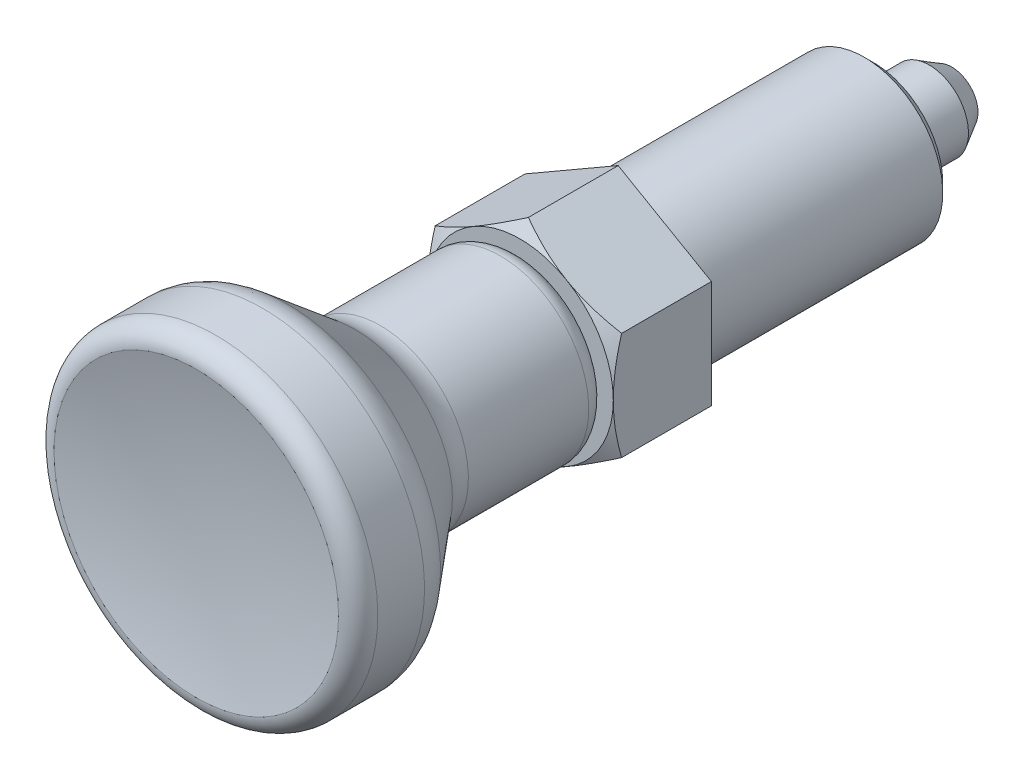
ISO-10303-21;
HEADER;
FILE_DESCRIPTION(('STEP AP214'),'2;1');
FILE_NAME('part.step','',(''),(''),'','','');
FILE_SCHEMA(('AUTOMOTIVE_DESIGN { 1 0 10303 214 1 1 1 1 }'));
ENDSEC;
DATA;
#1=APPLICATION_CONTEXT('core data for automotive mechanical design processes');
#2=APPLICATION_PROTOCOL_DEFINITION('international standard','automotive_design',2000,#1);
#3=PRODUCT_CONTEXT('',#1,'mechanical');
#4=PRODUCT('Part','Part','',(#3));
#5=PRODUCT_RELATED_PRODUCT_CATEGORY('part','',(#4));
#6=PRODUCT_DEFINITION_FORMATION('','',#4);
#7=PRODUCT_DEFINITION_CONTEXT('part definition',#1,'design');
#8=PRODUCT_DEFINITION('design','',#6,#7);
#9=PRODUCT_DEFINITION_SHAPE('','',#8);
#10=(LENGTH_UNIT() NAMED_UNIT(*) SI_UNIT(.MILLI.,.METRE.));
#11=(NAMED_UNIT(*) PLANE_ANGLE_UNIT() SI_UNIT($,.RADIAN.));
#12=(NAMED_UNIT(*) SI_UNIT($,.STERADIAN.) SOLID_ANGLE_UNIT());
#13=UNCERTAINTY_MEASURE_WITH_UNIT(LENGTH_MEASURE(1.E-05),#10,'distance_accuracy_value','');
#14=(GEOMETRIC_REPRESENTATION_CONTEXT(3) GLOBAL_UNCERTAINTY_ASSIGNED_CONTEXT((#13)) GLOBAL_UNIT_ASSIGNED_CONTEXT((#10,
#11,#12)) REPRESENTATION_CONTEXT('',''));
#15=CARTESIAN_POINT('',(0.,0.,0.));
#16=DIRECTION('',(0.,0.,1.));
#17=DIRECTION('',(1.,0.,0.));
#18=AXIS2_PLACEMENT_3D('',#15,#16,#17);
#19=CARTESIAN_POINT('',(0.,0.,7.11324865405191));
#20=DIRECTION('',(0.,0.,-1.));
#21=DIRECTION('',(0.,1.,0.));
#22=AXIS2_PLACEMENT_3D('',#19,#20,#21);
#23=CONICAL_SURFACE('',#22,14.5,1.0471975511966);
#24=CARTESIAN_POINT('',(-9.5,14.831186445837,5.31601754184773));
#25=CARTESIAN_POINT('',(-9.5,14.6233179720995,5.41707413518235));
#26=CARTESIAN_POINT('',(-9.5,14.4152082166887,5.51763419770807));
#27=CARTESIAN_POINT('',(-9.5,13.9984558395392,5.71764899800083));
#28=CARTESIAN_POINT('',(-9.5,13.7898132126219,5.81710372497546));
#29=CARTESIAN_POINT('',(-9.5,13.1629563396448,6.11366709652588));
#30=CARTESIAN_POINT('',(-9.5,12.7438730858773,6.30894569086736));
#31=CARTESIAN_POINT('',(-9.5,11.9007007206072,6.69449097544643));
#32=CARTESIAN_POINT('',(-9.5,11.4765968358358,6.88472543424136));
#33=CARTESIAN_POINT('',(-9.5,10.6250509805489,7.25754291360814));
#34=CARTESIAN_POINT('',(-9.5,10.1976091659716,7.44012628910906));
#35=CARTESIAN_POINT('',(-9.5,9.32451446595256,7.80149431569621));
#36=CARTESIAN_POINT('',(-9.5,8.87872644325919,7.97995423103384));
#37=CARTESIAN_POINT('',(-9.5,7.9819724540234,8.32360429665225));
#38=CARTESIAN_POINT('',(-9.5,7.53100591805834,8.48879297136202));
#39=CARTESIAN_POINT('',(-9.5,6.62398479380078,8.80163505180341));
#40=CARTESIAN_POINT('',(-9.5,6.16794229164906,8.94932312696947));
#41=CARTESIAN_POINT('',(-9.5,5.24933198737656,9.22249164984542));
#42=CARTESIAN_POINT('',(-9.5,4.78676625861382,9.34797898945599));
#43=CARTESIAN_POINT('',(-9.5,3.85736961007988,9.57010535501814));
#44=CARTESIAN_POINT('',(-9.5,3.39057816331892,9.66690512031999));
#45=CARTESIAN_POINT('',(-9.5,2.68606246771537,9.78645195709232));
#46=CARTESIAN_POINT('',(-9.5,2.45048585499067,9.82202702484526));
#47=CARTESIAN_POINT('',(-9.5,1.97812856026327,9.88393086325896));
#48=CARTESIAN_POINT('',(-9.5,1.7413479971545,9.91026052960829));
#49=CARTESIAN_POINT('',(-9.5,1.27003593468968,9.95281359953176));
#50=CARTESIAN_POINT('',(-9.5,1.0355161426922,9.96916614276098));
#51=CARTESIAN_POINT('',(-9.5,0.565994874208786,9.99193415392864));
#52=CARTESIAN_POINT('',(-9.5,0.330993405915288,9.99834978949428));
#53=CARTESIAN_POINT('',(-9.5,-0.139070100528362,10.0010905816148));
#54=CARTESIAN_POINT('',(-9.5,-0.374132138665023,9.9974157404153));
#55=CARTESIAN_POINT('',(-9.5,-0.843889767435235,9.98006674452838));
#56=CARTESIAN_POINT('',(-9.5,-1.07858533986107,9.96639210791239));
#57=CARTESIAN_POINT('',(-9.5,-1.63968713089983,9.92203744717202));
#58=CARTESIAN_POINT('',(-9.5,-1.96573914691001,9.88677643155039));
#59=CARTESIAN_POINT('',(-9.5,-2.61547197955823,9.79885612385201));
#60=CARTESIAN_POINT('',(-9.5,-2.93915247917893,9.74619454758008));
#61=CARTESIAN_POINT('',(-9.5,-3.9062404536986,9.56489716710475));
#62=CARTESIAN_POINT('',(-9.5,-4.54534395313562,9.41298013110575));
#63=CARTESIAN_POINT('',(-9.5,-5.5010788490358,9.14892008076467));
#64=CARTESIAN_POINT('',(-9.5,-5.82265147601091,9.05362699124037));
#65=CARTESIAN_POINT('',(-9.5,-6.46267510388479,8.8529854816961));
#66=CARTESIAN_POINT('',(-9.5,-6.78112608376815,8.74763699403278));
#67=CARTESIAN_POINT('',(-9.5,-7.41500318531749,8.52858799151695));
#68=CARTESIAN_POINT('',(-9.5,-7.730430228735,8.4148901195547));
#69=CARTESIAN_POINT('',(-9.5,-8.35866067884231,8.18049578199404));
#70=CARTESIAN_POINT('',(-9.5,-8.67146411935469,8.05979940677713));
#71=CARTESIAN_POINT('',(-9.5,-9.42126867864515,7.76237588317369));
#72=CARTESIAN_POINT('',(-9.5,-9.85713562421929,7.58279443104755));
#73=CARTESIAN_POINT('',(-9.5,-10.7250487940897,7.21459723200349));
#74=CARTESIAN_POINT('',(-9.5,-11.1570947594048,7.02598087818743));
#75=CARTESIAN_POINT('',(-9.5,-12.0180952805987,6.64156036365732));
#76=CARTESIAN_POINT('',(-9.5,-12.4470490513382,6.44575444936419));
#77=CARTESIAN_POINT('',(-9.5,-13.3022867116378,6.04843682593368));
#78=CARTESIAN_POINT('',(-9.5,-13.7285706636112,5.84692525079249));
#79=CARTESIAN_POINT('',(-9.5,-14.5794187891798,5.43904569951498));
#80=CARTESIAN_POINT('',(-9.5,-15.0039803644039,5.23267231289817));
#81=CARTESIAN_POINT('',(-9.5,-15.851242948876,4.81614147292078));
#82=CARTESIAN_POINT('',(-9.5,-16.2739439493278,4.60598400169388));
#83=CARTESIAN_POINT('',(-9.5,-17.1177171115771,4.18257534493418));
#84=CARTESIAN_POINT('',(-9.5,-17.5387894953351,3.96932460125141));
#85=CARTESIAN_POINT('',(-9.5,-18.3796041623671,3.5402154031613));
#86=CARTESIAN_POINT('',(-9.5,-18.7993464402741,3.32435693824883));
#87=CARTESIAN_POINT('',(-9.5,-19.9842654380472,2.71108738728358));
#88=CARTESIAN_POINT('',(-9.5,-20.7481213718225,2.31112448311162));
#89=CARTESIAN_POINT('',(-9.5,-22.2729985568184,1.50577288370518));
#90=CARTESIAN_POINT('',(-9.5,-23.0340196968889,1.10038397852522));
#91=CARTESIAN_POINT('',(-9.5,-24.5518349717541,0.286542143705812));
#92=CARTESIAN_POINT('',(-9.5,-25.3086349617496,-0.121899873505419));
#93=CARTESIAN_POINT('',(-9.5,-26.4425036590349,-0.736961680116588));
#94=CARTESIAN_POINT('',(-9.5,-26.8202271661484,-0.94237613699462));
#95=CARTESIAN_POINT('',(-9.5,-27.5752815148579,-1.35392414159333));
#96=CARTESIAN_POINT('',(-9.5,-27.9526123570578,-1.56005768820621));
#97=CARTESIAN_POINT('',(-9.5,-28.3297693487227,-1.76650892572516));
#98=B_SPLINE_CURVE_WITH_KNOTS('',3,(#24,#25,#26,#27,#28,#29,#30,#31,#32,#33,#34,#35,#36,#37,#38,
#39,#40,#41,#42,#43,#44,#45,#46,#47,#48,#49,#50,#51,#52,#53,#54,#55,#56,#57,#58,#59,#60,#61,#62,
#63,#64,#65,#66,#67,#68,#69,#70,#71,#72,#73,#74,#75,#76,#77,#78,#79,#80,#81,#82,#83,#84,#85,#86,
#87,#88,#89,#90,#91,#92,#93,#94,#95,#96,#97),.UNSPECIFIED.,.F.,.F.,(4,2,2,2,2,2,2,2,2,2,2,2,2,2,
2,2,2,2,2,2,2,2,2,2,2,2,2,2,2,2,2,2,2,2,2,2,4),(0.,0.693393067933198,1.38679290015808,
2.77379274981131,4.16817950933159,5.56250151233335,7.00288402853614,8.44342647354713,
9.88106566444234,11.3182577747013,12.7472379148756,13.4618279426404,14.176348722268,
14.881413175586,15.5864657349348,16.291518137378,16.9966045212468,17.9799102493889,
18.9633451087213,20.9312656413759,21.9373639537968,22.9434690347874,23.9492570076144,
24.9550319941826,26.3691296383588,27.7833224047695,29.1978624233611,30.6123692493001,
32.028532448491,33.4447023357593,34.860671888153,36.2766471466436,38.8633137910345,
41.4500808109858,44.0300197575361,45.3199150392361,46.6098083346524),.UNSPECIFIED.);
#99=CARTESIAN_POINT('',(-9.5,-5.4848275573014,9.15149422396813));
#100=VERTEX_POINT('',#99);
#101=CARTESIAN_POINT('',(-9.5,0.,10.));
#102=VERTEX_POINT('',#101);
#103=EDGE_CURVE('E9',#100,#102,#98,.F.);
#104=ORIENTED_EDGE('',*,*,#103,.F.);
#105=CARTESIAN_POINT('',(0.000200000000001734,-10.9697705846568,9.15142755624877));
#106=CARTESIAN_POINT('',(-0.208630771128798,-10.8492020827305,9.22102656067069));
#107=CARTESIAN_POINT('',(-0.418240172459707,-10.7281840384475,9.28746669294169));
#108=CARTESIAN_POINT('',(-0.839139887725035,-10.4851774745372,9.41315271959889));
#109=CARTESIAN_POINT('',(-1.05043073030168,-10.3631886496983,9.47239624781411));
#110=CARTESIAN_POINT('',(-1.68770779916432,-9.99525656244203,9.63818542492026));
#111=CARTESIAN_POINT('',(-2.11620976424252,-9.74786083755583,9.73248555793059));
#112=CARTESIAN_POINT('',(-2.75744333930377,-9.37764446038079,9.84306129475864));
#113=CARTESIAN_POINT('',(-2.96825921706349,-9.25592985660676,9.87456017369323));
#114=CARTESIAN_POINT('',(-3.39086703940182,-9.01193711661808,9.92738179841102));
#115=CARTESIAN_POINT('',(-3.60265900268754,-8.88965896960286,9.94870434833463));
#116=CARTESIAN_POINT('',(-4.02659621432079,-8.6448987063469,9.98062697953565));
#117=CARTESIAN_POINT('',(-4.23874074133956,-8.52241700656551,9.99123980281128));
#118=CARTESIAN_POINT('',(-4.66322575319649,-8.27734047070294,10.0015174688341));
#119=CARTESIAN_POINT('',(-4.87556623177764,-8.15474563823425,10.0011826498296));
#120=CARTESIAN_POINT('',(-5.27254199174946,-7.92555157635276,9.99032663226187));
#121=CARTESIAN_POINT('',(-5.45720529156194,-7.81893617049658,9.98112973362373));
#122=CARTESIAN_POINT('',(-5.82610000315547,-7.60595470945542,9.95463460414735));
#123=CARTESIAN_POINT('',(-6.01033138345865,-7.4995886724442,9.93733580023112));
#124=CARTESIAN_POINT('',(-6.56231167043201,-7.18090270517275,9.87369551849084));
#125=CARTESIAN_POINT('',(-6.92908353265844,-6.96914687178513,9.81561809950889));
#126=CARTESIAN_POINT('',(-7.66651782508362,-6.54338898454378,9.67042398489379));
#127=CARTESIAN_POINT('',(-8.03708614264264,-6.32944126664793,9.58269183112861));
#128=CARTESIAN_POINT('',(-8.77269671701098,-5.90473630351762,9.38357626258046));
#129=CARTESIAN_POINT('',(-9.137748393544,-5.69397361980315,9.27223961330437));
#130=CARTESIAN_POINT('',(-9.5002,-5.48471208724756,9.15142755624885));
#131=B_SPLINE_CURVE_WITH_KNOTS('',3,(#105,#106,#107,#108,#109,#110,#111,#112,#113,#114,#115,
#116,#117,#118,#119,#120,#121,#122,#123,#124,#125,#126,#127,#128,#129,#130),.UNSPECIFIED.,.F.,
.F.,(4,2,2,2,2,2,2,2,2,2,2,2,4),(0.,0.752880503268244,1.50600787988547,3.01546870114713,
3.75167336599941,4.4878921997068,5.22323407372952,5.95855322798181,6.59868084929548,
7.23885375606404,8.52010929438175,9.82978009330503,11.1368800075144),.UNSPECIFIED.);
#132=CARTESIAN_POINT('',(-4.75000000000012,-8.22724133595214,10.));
#133=VERTEX_POINT('',#132);
#134=EDGE_CURVE('E204',#133,#100,#131,.T.);
#135=ORIENTED_EDGE('',*,*,#134,.F.);
#136=CARTESIAN_POINT('',(0.,0.,10.));
#137=DIRECTION('',(0.,0.,1.));
#138=DIRECTION('',(0.,-1.,0.));
#139=AXIS2_PLACEMENT_3D('',#136,#137,#138);
#140=CIRCLE('',#139,9.5);
#141=EDGE_CURVE('E262',#102,#133,#140,.T.);
#142=ORIENTED_EDGE('',*,*,#141,.F.);
#143=EDGE_LOOP('',(#104,#135,#142));
#144=FACE_BOUND('',#143,.T.);
#145=ADVANCED_FACE('F14',(#144),#23,.T.);
#146=CARTESIAN_POINT('',(-9.5,5.4848275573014,9.15149422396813));
#147=VERTEX_POINT('',#146);
#148=EDGE_CURVE('E18',#102,#147,#98,.F.);
#149=ORIENTED_EDGE('',*,*,#148,.F.);
#150=CARTESIAN_POINT('',(-4.75000000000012,8.22724133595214,10.));
#151=VERTEX_POINT('',#150);
#152=EDGE_CURVE('E116',#151,#102,#140,.T.);
#153=ORIENTED_EDGE('',*,*,#152,.F.);
#154=CARTESIAN_POINT('',(-9.5002,5.48471208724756,9.15142755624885));
#155=CARTESIAN_POINT('',(-9.2913692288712,5.60528058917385,9.22102656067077));
#156=CARTESIAN_POINT('',(-9.0817598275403,5.72629863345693,9.28746669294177));
#157=CARTESIAN_POINT('',(-8.66086011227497,5.96930519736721,9.41315271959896));
#158=CARTESIAN_POINT('',(-8.44956926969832,6.09129402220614,9.47239624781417));
#159=CARTESIAN_POINT('',(-7.81229220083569,6.45922610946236,9.63818542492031));
#160=CARTESIAN_POINT('',(-7.38379023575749,6.70662183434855,9.73248555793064));
#161=CARTESIAN_POINT('',(-6.74255666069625,7.0768382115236,9.84306129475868));
#162=CARTESIAN_POINT('',(-6.53174078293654,7.19855281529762,9.87456017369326));
#163=CARTESIAN_POINT('',(-6.10913296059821,7.4425455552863,9.92738179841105));
#164=CARTESIAN_POINT('',(-5.89734099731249,7.56482370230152,9.94870434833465));
#165=CARTESIAN_POINT('',(-5.47340378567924,7.80958396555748,9.98062697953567));
#166=CARTESIAN_POINT('',(-5.26125925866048,7.93206566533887,9.99123980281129));
#167=CARTESIAN_POINT('',(-4.83677424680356,8.17714220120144,10.0015174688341));
#168=CARTESIAN_POINT('',(-4.6244337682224,8.29973703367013,10.0011826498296));
#169=CARTESIAN_POINT('',(-4.22745800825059,8.52893109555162,9.99032663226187));
#170=CARTESIAN_POINT('',(-4.0427947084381,8.6355465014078,9.98112973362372));
#171=CARTESIAN_POINT('',(-3.67389999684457,8.84852796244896,9.95463460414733));
#172=CARTESIAN_POINT('',(-3.48966861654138,8.95489399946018,9.9373358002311));
#173=CARTESIAN_POINT('',(-2.93768832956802,9.27357996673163,9.87369551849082));
#174=CARTESIAN_POINT('',(-2.57091646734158,9.48533580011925,9.81561809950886));
#175=CARTESIAN_POINT('',(-1.8334821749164,9.9110936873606,9.67042398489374));
#176=CARTESIAN_POINT('',(-1.46291385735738,10.1250414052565,9.58269183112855));
#177=CARTESIAN_POINT('',(-0.727303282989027,10.5497463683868,9.38357626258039));
#178=CARTESIAN_POINT('',(-0.362251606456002,10.7605090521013,9.2722396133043));
#179=CARTESIAN_POINT('',(0.000199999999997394,10.9697705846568,9.15142755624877));
#180=B_SPLINE_CURVE_WITH_KNOTS('',3,(#154,#155,#156,#157,#158,#159,#160,#161,#162,#163,#164,
#165,#166,#167,#168,#169,#170,#171,#172,#173,#174,#175,#176,#177,#178,#179),.UNSPECIFIED.,.F.,
.F.,(4,2,2,2,2,2,2,2,2,2,2,2,4),(0.,0.752880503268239,1.50600787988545,3.0154687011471,
3.75167336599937,4.48789219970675,5.22323407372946,5.95855322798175,6.59868084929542,
7.23885375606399,8.52010929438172,9.82978009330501,11.1368800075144),.UNSPECIFIED.);
#181=EDGE_CURVE('E265',#147,#151,#180,.T.);
#182=ORIENTED_EDGE('',*,*,#181,.F.);
#183=EDGE_LOOP('',(#149,#153,#182));
#184=FACE_BOUND('',#183,.T.);
#185=ADVANCED_FACE('F226',(#184),#23,.T.);
#186=CARTESIAN_POINT('',(0.,10.969655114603,9.15149422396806));
#187=VERTEX_POINT('',#186);
#188=EDGE_CURVE('E112',#151,#187,#180,.T.);
#189=ORIENTED_EDGE('',*,*,#188,.F.);
#190=CARTESIAN_POINT('',(4.75000000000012,8.22724133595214,10.));
#191=VERTEX_POINT('',#190);
#192=EDGE_CURVE('E110',#191,#151,#140,.T.);
#193=ORIENTED_EDGE('',*,*,#192,.F.);
#194=CARTESIAN_POINT('',(-0.000200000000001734,10.9697705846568,9.15142755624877));
#195=CARTESIAN_POINT('',(0.208630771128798,10.8492020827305,9.22102656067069));
#196=CARTESIAN_POINT('',(0.418240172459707,10.7281840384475,9.28746669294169));
#197=CARTESIAN_POINT('',(0.839139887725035,10.4851774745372,9.41315271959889));
#198=CARTESIAN_POINT('',(1.05043073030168,10.3631886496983,9.47239624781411));
#199=CARTESIAN_POINT('',(1.68770779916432,9.99525656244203,9.63818542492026));
#200=CARTESIAN_POINT('',(2.11620976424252,9.74786083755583,9.73248555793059));
#201=CARTESIAN_POINT('',(2.75744333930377,9.37764446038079,9.84306129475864));
#202=CARTESIAN_POINT('',(2.96825921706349,9.25592985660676,9.87456017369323));
#203=CARTESIAN_POINT('',(3.39086703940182,9.01193711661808,9.92738179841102));
#204=CARTESIAN_POINT('',(3.60265900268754,8.88965896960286,9.94870434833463));
#205=CARTESIAN_POINT('',(4.02659621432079,8.6448987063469,9.98062697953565));
#206=CARTESIAN_POINT('',(4.23874074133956,8.52241700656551,9.99123980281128));
#207=CARTESIAN_POINT('',(4.66322575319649,8.27734047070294,10.0015174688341));
#208=CARTESIAN_POINT('',(4.87556623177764,8.15474563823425,10.0011826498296));
#209=CARTESIAN_POINT('',(5.27254199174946,7.92555157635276,9.99032663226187));
#210=CARTESIAN_POINT('',(5.45720529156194,7.81893617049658,9.98112973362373));
#211=CARTESIAN_POINT('',(5.82610000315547,7.60595470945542,9.95463460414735));
#212=CARTESIAN_POINT('',(6.01033138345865,7.4995886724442,9.93733580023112));
#213=CARTESIAN_POINT('',(6.56231167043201,7.18090270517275,9.87369551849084));
#214=CARTESIAN_POINT('',(6.92908353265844,6.96914687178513,9.81561809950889));
#215=CARTESIAN_POINT('',(7.66651782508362,6.54338898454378,9.67042398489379));
#216=CARTESIAN_POINT('',(8.03708614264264,6.32944126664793,9.58269183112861));
#217=CARTESIAN_POINT('',(8.77269671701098,5.90473630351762,9.38357626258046));
#218=CARTESIAN_POINT('',(9.137748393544,5.69397361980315,9.27223961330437));
#219=CARTESIAN_POINT('',(9.5002,5.48471208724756,9.15142755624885));
#220=B_SPLINE_CURVE_WITH_KNOTS('',3,(#194,#195,#196,#197,#198,#199,#200,#201,#202,#203,#204,
#205,#206,#207,#208,#209,#210,#211,#212,#213,#214,#215,#216,#217,#218,#219),.UNSPECIFIED.,.F.,
.F.,(4,2,2,2,2,2,2,2,2,2,2,2,4),(0.,0.752880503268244,1.50600787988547,3.01546870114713,
3.75167336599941,4.4878921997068,5.22323407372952,5.95855322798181,6.59868084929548,
7.23885375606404,8.52010929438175,9.82978009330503,11.1368800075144),.UNSPECIFIED.);
#221=EDGE_CURVE('E90',#187,#191,#220,.T.);
#222=ORIENTED_EDGE('',*,*,#221,.F.);
#223=EDGE_LOOP('',(#189,#193,#222));
#224=FACE_BOUND('',#223,.T.);
#225=ADVANCED_FACE('F111',(#224),#23,.T.);
#226=CARTESIAN_POINT('',(0.,-10.969655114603,9.15149422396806));
#227=VERTEX_POINT('',#226);
#228=EDGE_CURVE('E199',#227,#133,#131,.T.);
#229=ORIENTED_EDGE('',*,*,#228,.F.);
#230=CARTESIAN_POINT('',(9.5002,-5.48471208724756,9.15142755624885));
#231=CARTESIAN_POINT('',(9.2913692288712,-5.60528058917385,9.22102656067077));
#232=CARTESIAN_POINT('',(9.0817598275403,-5.72629863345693,9.28746669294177));
#233=CARTESIAN_POINT('',(8.66086011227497,-5.96930519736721,9.41315271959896));
#234=CARTESIAN_POINT('',(8.44956926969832,-6.09129402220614,9.47239624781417));
#235=CARTESIAN_POINT('',(7.8122922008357,-6.45922610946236,9.63818542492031));
#236=CARTESIAN_POINT('',(7.38379023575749,-6.70662183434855,9.73248555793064));
#237=CARTESIAN_POINT('',(6.74255666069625,-7.0768382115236,9.84306129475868));
#238=CARTESIAN_POINT('',(6.53174078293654,-7.19855281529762,9.87456017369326));
#239=CARTESIAN_POINT('',(6.10913296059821,-7.4425455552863,9.92738179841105));
#240=CARTESIAN_POINT('',(5.89734099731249,-7.56482370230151,9.94870434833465));
#241=CARTESIAN_POINT('',(5.47340378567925,-7.80958396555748,9.98062697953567));
#242=CARTESIAN_POINT('',(5.26125925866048,-7.93206566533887,9.99123980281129));
#243=CARTESIAN_POINT('',(4.83677424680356,-8.17714220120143,10.0015174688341));
#244=CARTESIAN_POINT('',(4.6244337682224,-8.29973703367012,10.0011826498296));
#245=CARTESIAN_POINT('',(4.22745800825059,-8.52893109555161,9.99032663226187));
#246=CARTESIAN_POINT('',(4.0427947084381,-8.6355465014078,9.98112973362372));
#247=CARTESIAN_POINT('',(3.67389999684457,-8.84852796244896,9.95463460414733));
#248=CARTESIAN_POINT('',(3.48966861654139,-8.95489399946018,9.9373358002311));
#249=CARTESIAN_POINT('',(2.93768832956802,-9.27357996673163,9.87369551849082));
#250=CARTESIAN_POINT('',(2.57091646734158,-9.48533580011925,9.81561809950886));
#251=CARTESIAN_POINT('',(1.8334821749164,-9.9110936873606,9.67042398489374));
#252=CARTESIAN_POINT('',(1.46291385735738,-10.1250414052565,9.58269183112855));
#253=CARTESIAN_POINT('',(0.727303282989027,-10.5497463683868,9.38357626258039));
#254=CARTESIAN_POINT('',(0.362251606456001,-10.7605090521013,9.2722396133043));
#255=CARTESIAN_POINT('',(-0.000199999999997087,-10.9697705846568,9.15142755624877));
#256=B_SPLINE_CURVE_WITH_KNOTS('',3,(#230,#231,#232,#233,#234,#235,#236,#237,#238,#239,#240,
#241,#242,#243,#244,#245,#246,#247,#248,#249,#250,#251,#252,#253,#254,#255),.UNSPECIFIED.,.F.,
.F.,(4,2,2,2,2,2,2,2,2,2,2,2,4),(0.,0.752880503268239,1.50600787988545,3.01546870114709,
3.75167336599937,4.48789219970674,5.22323407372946,5.95855322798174,6.59868084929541,
7.23885375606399,8.52010929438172,9.82978009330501,11.1368800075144),.UNSPECIFIED.);
#257=CARTESIAN_POINT('',(4.75000000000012,-8.22724133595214,10.));
#258=VERTEX_POINT('',#257);
#259=EDGE_CURVE('E100',#258,#227,#256,.T.);
#260=ORIENTED_EDGE('',*,*,#259,.F.);
#261=EDGE_CURVE('E123',#133,#258,#140,.T.);
#262=ORIENTED_EDGE('',*,*,#261,.F.);
#263=EDGE_LOOP('',(#229,#260,#262));
#264=FACE_BOUND('',#263,.T.);
#265=ADVANCED_FACE('F244',(#264),#23,.T.);
#266=CARTESIAN_POINT('',(9.5,5.4848275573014,9.15149422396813));
#267=VERTEX_POINT('',#266);
#268=EDGE_CURVE('E94',#191,#267,#220,.T.);
#269=ORIENTED_EDGE('',*,*,#268,.F.);
#270=CARTESIAN_POINT('',(9.5,0.,10.));
#271=VERTEX_POINT('',#270);
#272=EDGE_CURVE('E106',#271,#191,#140,.T.);
#273=ORIENTED_EDGE('',*,*,#272,.F.);
#274=CARTESIAN_POINT('',(9.5,14.831186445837,5.31601754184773));
#275=CARTESIAN_POINT('',(9.5,14.6233179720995,5.41707413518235));
#276=CARTESIAN_POINT('',(9.5,14.4152082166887,5.51763419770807));
#277=CARTESIAN_POINT('',(9.5,13.9984558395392,5.71764899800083));
#278=CARTESIAN_POINT('',(9.5,13.7898132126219,5.81710372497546));
#279=CARTESIAN_POINT('',(9.5,13.1629563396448,6.11366709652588));
#280=CARTESIAN_POINT('',(9.5,12.7438730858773,6.30894569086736));
#281=CARTESIAN_POINT('',(9.5,11.9007007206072,6.69449097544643));
#282=CARTESIAN_POINT('',(9.5,11.4765968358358,6.88472543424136));
#283=CARTESIAN_POINT('',(9.5,10.6250509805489,7.25754291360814));
#284=CARTESIAN_POINT('',(9.5,10.1976091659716,7.44012628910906));
#285=CARTESIAN_POINT('',(9.5,9.32451446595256,7.80149431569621));
#286=CARTESIAN_POINT('',(9.5,8.87872644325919,7.97995423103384));
#287=CARTESIAN_POINT('',(9.5,7.9819724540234,8.32360429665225));
#288=CARTESIAN_POINT('',(9.5,7.53100591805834,8.48879297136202));
#289=CARTESIAN_POINT('',(9.5,6.62398479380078,8.80163505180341));
#290=CARTESIAN_POINT('',(9.5,6.16794229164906,8.94932312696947));
#291=CARTESIAN_POINT('',(9.5,5.24933198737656,9.22249164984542));
#292=CARTESIAN_POINT('',(9.5,4.78676625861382,9.34797898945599));
#293=CARTESIAN_POINT('',(9.5,3.85736961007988,9.57010535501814));
#294=CARTESIAN_POINT('',(9.5,3.39057816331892,9.66690512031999));
#295=CARTESIAN_POINT('',(9.5,2.68606246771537,9.78645195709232));
#296=CARTESIAN_POINT('',(9.5,2.45048585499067,9.82202702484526));
#297=CARTESIAN_POINT('',(9.5,1.97812856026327,9.88393086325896));
#298=CARTESIAN_POINT('',(9.5,1.7413479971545,9.91026052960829));
#299=CARTESIAN_POINT('',(9.5,1.27003593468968,9.95281359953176));
#300=CARTESIAN_POINT('',(9.5,1.0355161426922,9.96916614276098));
#301=CARTESIAN_POINT('',(9.5,0.565994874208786,9.99193415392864));
#302=CARTESIAN_POINT('',(9.5,0.330993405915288,9.99834978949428));
#303=CARTESIAN_POINT('',(9.5,-0.139070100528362,10.0010905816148));
#304=CARTESIAN_POINT('',(9.5,-0.374132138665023,9.9974157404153));
#305=CARTESIAN_POINT('',(9.5,-0.843889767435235,9.98006674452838));
#306=CARTESIAN_POINT('',(9.5,-1.07858533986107,9.96639210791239));
#307=CARTESIAN_POINT('',(9.5,-1.63968713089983,9.92203744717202));
#308=CARTESIAN_POINT('',(9.5,-1.96573914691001,9.88677643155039));
#309=CARTESIAN_POINT('',(9.5,-2.61547197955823,9.79885612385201));
#310=CARTESIAN_POINT('',(9.5,-2.93915247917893,9.74619454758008));
#311=CARTESIAN_POINT('',(9.5,-3.9062404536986,9.56489716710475));
#312=CARTESIAN_POINT('',(9.5,-4.54534395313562,9.41298013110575));
#313=CARTESIAN_POINT('',(9.5,-5.5010788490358,9.14892008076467));
#314=CARTESIAN_POINT('',(9.5,-5.82265147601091,9.05362699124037));
#315=CARTESIAN_POINT('',(9.5,-6.46267510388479,8.8529854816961));
#316=CARTESIAN_POINT('',(9.5,-6.78112608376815,8.74763699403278));
#317=CARTESIAN_POINT('',(9.5,-7.41500318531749,8.52858799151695));
#318=CARTESIAN_POINT('',(9.5,-7.730430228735,8.4148901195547));
#319=CARTESIAN_POINT('',(9.5,-8.35866067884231,8.18049578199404));
#320=CARTESIAN_POINT('',(9.5,-8.67146411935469,8.05979940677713));
#321=CARTESIAN_POINT('',(9.5,-9.42126867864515,7.76237588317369));
#322=CARTESIAN_POINT('',(9.5,-9.85713562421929,7.58279443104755));
#323=CARTESIAN_POINT('',(9.5,-10.7250487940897,7.21459723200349));
#324=CARTESIAN_POINT('',(9.5,-11.1570947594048,7.02598087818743));
#325=CARTESIAN_POINT('',(9.5,-12.0180952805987,6.64156036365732));
#326=CARTESIAN_POINT('',(9.5,-12.4470490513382,6.44575444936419));
#327=CARTESIAN_POINT('',(9.5,-13.3022867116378,6.04843682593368));
#328=CARTESIAN_POINT('',(9.5,-13.7285706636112,5.84692525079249));
#329=CARTESIAN_POINT('',(9.5,-14.5794187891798,5.43904569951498));
#330=CARTESIAN_POINT('',(9.5,-15.0039803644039,5.23267231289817));
#331=CARTESIAN_POINT('',(9.5,-15.851242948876,4.81614147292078));
#332=CARTESIAN_POINT('',(9.5,-16.2739439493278,4.60598400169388));
#333=CARTESIAN_POINT('',(9.5,-17.1177171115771,4.18257534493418));
#334=CARTESIAN_POINT('',(9.5,-17.5387894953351,3.96932460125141));
#335=CARTESIAN_POINT('',(9.5,-18.3796041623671,3.5402154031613));
#336=CARTESIAN_POINT('',(9.5,-18.7993464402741,3.32435693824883));
#337=CARTESIAN_POINT('',(9.5,-19.9842654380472,2.71108738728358));
#338=CARTESIAN_POINT('',(9.5,-20.7481213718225,2.31112448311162));
#339=CARTESIAN_POINT('',(9.5,-22.2729985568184,1.50577288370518));
#340=CARTESIAN_POINT('',(9.5,-23.0340196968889,1.10038397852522));
#341=CARTESIAN_POINT('',(9.5,-24.5518349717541,0.286542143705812));
#342=CARTESIAN_POINT('',(9.5,-25.3086349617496,-0.121899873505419));
#343=CARTESIAN_POINT('',(9.5,-26.4425036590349,-0.736961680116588));
#344=CARTESIAN_POINT('',(9.5,-26.8202271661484,-0.94237613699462));
#345=CARTESIAN_POINT('',(9.5,-27.5752815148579,-1.35392414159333));
#346=CARTESIAN_POINT('',(9.5,-27.9526123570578,-1.56005768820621));
#347=CARTESIAN_POINT('',(9.5,-28.3297693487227,-1.76650892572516));
#348=B_SPLINE_CURVE_WITH_KNOTS('',3,(#274,#275,#276,#277,#278,#279,#280,#281,#282,#283,#284,
#285,#286,#287,#288,#289,#290,#291,#292,#293,#294,#295,#296,#297,#298,#299,#300,#301,#302,#303,
#304,#305,#306,#307,#308,#309,#310,#311,#312,#313,#314,#315,#316,#317,#318,#319,#320,#321,#322,
#323,#324,#325,#326,#327,#328,#329,#330,#331,#332,#333,#334,#335,#336,#337,#338,#339,#340,#341,
#342,#343,#344,#345,#346,#347),.UNSPECIFIED.,.F.,.F.,(4,2,2,2,2,2,2,2,2,2,2,2,2,2,2,2,2,2,2,2,2,
2,2,2,2,2,2,2,2,2,2,2,2,2,2,2,4),(0.,0.693393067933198,1.38679290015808,2.77379274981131,
4.16817950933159,5.56250151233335,7.00288402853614,8.44342647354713,9.88106566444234,
11.3182577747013,12.7472379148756,13.4618279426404,14.176348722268,14.881413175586,
15.5864657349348,16.291518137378,16.9966045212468,17.9799102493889,18.9633451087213,
20.9312656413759,21.9373639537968,22.9434690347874,23.9492570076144,24.9550319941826,
26.3691296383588,27.7833224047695,29.1978624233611,30.6123692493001,32.028532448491,
33.4447023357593,34.860671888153,36.2766471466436,38.8633137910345,41.4500808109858,
44.0300197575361,45.3199150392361,46.6098083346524),.UNSPECIFIED.);
#349=EDGE_CURVE('E41',#267,#271,#348,.T.);
#350=ORIENTED_EDGE('',*,*,#349,.F.);
#351=EDGE_LOOP('',(#269,#273,#350));
#352=FACE_BOUND('',#351,.T.);
#353=ADVANCED_FACE('F104',(#352),#23,.T.);
#354=CARTESIAN_POINT('',(9.5,-5.4848275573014,9.15149422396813));
#355=VERTEX_POINT('',#354);
#356=EDGE_CURVE('E108',#355,#258,#256,.T.);
#357=ORIENTED_EDGE('',*,*,#356,.F.);
#358=EDGE_CURVE('E169',#271,#355,#348,.T.);
#359=ORIENTED_EDGE('',*,*,#358,.F.);
#360=EDGE_CURVE('E121',#258,#271,#140,.T.);
#361=ORIENTED_EDGE('',*,*,#360,.F.);
#362=EDGE_LOOP('',(#357,#359,#361));
#363=FACE_BOUND('',#362,.T.);
#364=ADVANCED_FACE('F228',(#363),#23,.T.);
#365=CARTESIAN_POINT('',(-1.11213122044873E-11,0.,107.387498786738));
#366=DIRECTION('',(0.,0.,1.));
#367=DIRECTION('',(1.,0.,0.));
#368=AXIS2_PLACEMENT_3D('',#365,#366,#367);
#369=SPHERICAL_SURFACE('',#368,66.0000000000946);
#370=CARTESIAN_POINT('',(0.,0.,43.));
#371=DIRECTION('',(0.,0.,1.));
#372=DIRECTION('',(0.,-1.,0.));
#373=AXIS2_PLACEMENT_3D('',#370,#371,#372);
#374=CIRCLE('',#373,14.500000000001);
#375=CARTESIAN_POINT('',(0.,-14.500000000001,43.));
#376=VERTEX_POINT('',#375);
#377=EDGE_CURVE('E166',#376,#376,#374,.T.);
#378=ORIENTED_EDGE('',*,*,#377,.T.);
#379=EDGE_LOOP('',(#378));
#380=FACE_BOUND('',#379,.T.);
#381=ADVANCED_FACE('F16',(#380),#369,.F.);
#382=CARTESIAN_POINT('',(0.,0.,41.));
#383=DIRECTION('',(0.,0.,1.));
#384=DIRECTION('',(0.,-1.,0.));
#385=AXIS2_PLACEMENT_3D('',#382,#383,#384);
#386=TOROIDAL_SURFACE('',#385,14.4999999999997,2.00000000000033);
#387=CARTESIAN_POINT('',(0.,0.,41.));
#388=DIRECTION('',(0.,0.,1.));
#389=DIRECTION('',(0.,-1.,0.));
#390=AXIS2_PLACEMENT_3D('',#387,#388,#389);
#391=CIRCLE('',#390,16.5);
#392=CARTESIAN_POINT('',(0.,-16.5,41.));
#393=VERTEX_POINT('',#392);
#394=EDGE_CURVE('E163',#393,#393,#391,.T.);
#395=ORIENTED_EDGE('',*,*,#394,.T.);
#396=EDGE_LOOP('',(#395));
#397=FACE_BOUND('',#396,.T.);
#398=ORIENTED_EDGE('',*,*,#377,.F.);
#399=EDGE_LOOP('',(#398));
#400=FACE_BOUND('',#399,.T.);
#401=ADVANCED_FACE('F242',(#397,#400),#386,.T.);
#402=CARTESIAN_POINT('',(0.,0.,-34.));
#403=DIRECTION('',(0.,0.,1.));
#404=DIRECTION('',(0.,-1.,0.));
#405=AXIS2_PLACEMENT_3D('',#402,#403,#404);
#406=CYLINDRICAL_SURFACE('',#405,16.5);
#407=CARTESIAN_POINT('',(0.,0.,36.235930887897));
#408=DIRECTION('',(0.,0.,1.));
#409=DIRECTION('',(0.,-1.,0.));
#410=AXIS2_PLACEMENT_3D('',#407,#408,#409);
#411=CIRCLE('',#410,16.5);
#412=CARTESIAN_POINT('',(0.,-16.5,36.235930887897));
#413=VERTEX_POINT('',#412);
#414=EDGE_CURVE('E160',#413,#413,#411,.T.);
#415=ORIENTED_EDGE('',*,*,#414,.T.);
#416=EDGE_LOOP('',(#415));
#417=FACE_BOUND('',#416,.T.);
#418=ORIENTED_EDGE('',*,*,#394,.F.);
#419=EDGE_LOOP('',(#418));
#420=FACE_BOUND('',#419,.T.);
#421=ADVANCED_FACE('F342',(#417,#420),#406,.T.);
#422=CARTESIAN_POINT('',(0.,0.,36.2359308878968));
#423=DIRECTION('',(0.,0.,1.));
#424=DIRECTION('',(0.,-1.,0.));
#425=AXIS2_PLACEMENT_3D('',#422,#423,#424);
#426=TOROIDAL_SURFACE('',#425,12.499999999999,4.00000000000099);
#427=CARTESIAN_POINT('',(0.,0.,33.691913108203));
#428=DIRECTION('',(0.,0.,1.));
#429=DIRECTION('',(0.,-1.,0.));
#430=AXIS2_PLACEMENT_3D('',#427,#428,#429);
#431=CIRCLE('',#430,15.586741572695);
#432=CARTESIAN_POINT('',(0.,-15.586741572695,33.691913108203));
#433=VERTEX_POINT('',#432);
#434=EDGE_CURVE('E157',#433,#433,#431,.T.);
#435=ORIENTED_EDGE('',*,*,#434,.T.);
#436=EDGE_LOOP('',(#435));
#437=FACE_BOUND('',#436,.T.);
#438=ORIENTED_EDGE('',*,*,#414,.F.);
#439=EDGE_LOOP('',(#438));
#440=FACE_BOUND('',#439,.T.);
#441=ADVANCED_FACE('F338',(#437,#440),#426,.T.);
#442=CARTESIAN_POINT('',(0.,0.,33.691913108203));
#443=DIRECTION('',(0.,0.,1.));
#444=DIRECTION('',(0.,-1.,0.));
#445=AXIS2_PLACEMENT_3D('',#442,#443,#444);
#446=CONICAL_SURFACE('',#445,15.586741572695,0.689309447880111);
#447=CARTESIAN_POINT('',(0.,0.,26.808086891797));
#448=DIRECTION('',(0.,0.,1.));
#449=DIRECTION('',(0.,-1.,0.));
#450=AXIS2_PLACEMENT_3D('',#447,#448,#449);
#451=CIRCLE('',#450,9.9132584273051);
#452=CARTESIAN_POINT('',(0.,-9.9132584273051,26.808086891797));
#453=VERTEX_POINT('',#452);
#454=EDGE_CURVE('E154',#453,#453,#451,.T.);
#455=ORIENTED_EDGE('',*,*,#454,.T.);
#456=EDGE_LOOP('',(#455));
#457=FACE_BOUND('',#456,.T.);
#458=ORIENTED_EDGE('',*,*,#434,.F.);
#459=EDGE_LOOP('',(#458));
#460=FACE_BOUND('',#459,.T.);
#461=ADVANCED_FACE('F334',(#457,#460),#446,.T.);
#462=CARTESIAN_POINT('',(0.,0.,24.2640691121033));
#463=DIRECTION('',(0.,0.,1.));
#464=DIRECTION('',(0.,-1.,0.));
#465=AXIS2_PLACEMENT_3D('',#462,#463,#464);
#466=TOROIDAL_SURFACE('',#465,13.0000000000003,4.00000000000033);
#467=CARTESIAN_POINT('',(0.,0.,24.264069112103));
#468=DIRECTION('',(0.,0.,1.));
#469=DIRECTION('',(0.,-1.,0.));
#470=AXIS2_PLACEMENT_3D('',#467,#468,#469);
#471=CIRCLE('',#470,9.);
#472=CARTESIAN_POINT('',(0.,-9.,24.264069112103));
#473=VERTEX_POINT('',#472);
#474=EDGE_CURVE('E151',#473,#473,#471,.T.);
#475=ORIENTED_EDGE('',*,*,#474,.T.);
#476=EDGE_LOOP('',(#475));
#477=FACE_BOUND('',#476,.T.);
#478=ORIENTED_EDGE('',*,*,#454,.F.);
#479=EDGE_LOOP('',(#478));
#480=FACE_BOUND('',#479,.T.);
#481=ADVANCED_FACE('F330',(#477,#480),#466,.F.);
#482=CARTESIAN_POINT('',(0.,0.,-34.));
#483=DIRECTION('',(0.,0.,1.));
#484=DIRECTION('',(0.,-1.,0.));
#485=AXIS2_PLACEMENT_3D('',#482,#483,#484);
#486=CYLINDRICAL_SURFACE('',#485,9.);
#487=CARTESIAN_POINT('',(0.,0.,12.));
#488=DIRECTION('',(0.,0.,1.));
#489=DIRECTION('',(0.,-1.,0.));
#490=AXIS2_PLACEMENT_3D('',#487,#488,#489);
#491=CIRCLE('',#490,9.);
#492=CARTESIAN_POINT('',(0.,-9.,12.));
#493=VERTEX_POINT('',#492);
#494=EDGE_CURVE('E148',#493,#493,#491,.T.);
#495=ORIENTED_EDGE('',*,*,#494,.T.);
#496=EDGE_LOOP('',(#495));
#497=FACE_BOUND('',#496,.T.);
#498=ORIENTED_EDGE('',*,*,#474,.F.);
#499=EDGE_LOOP('',(#498));
#500=FACE_BOUND('',#499,.T.);
#501=ADVANCED_FACE('F326',(#497,#500),#486,.T.);
#502=CARTESIAN_POINT('',(0.,0.,12.));
#503=DIRECTION('',(0.,0.,1.));
#504=DIRECTION('',(0.,-1.,0.));
#505=AXIS2_PLACEMENT_3D('',#502,#503,#504);
#506=TOROIDAL_SURFACE('',#505,7.,2.);
#507=CARTESIAN_POINT('',(0.,0.,10.));
#508=DIRECTION('',(0.,0.,1.));
#509=DIRECTION('',(0.,-1.,0.));
#510=AXIS2_PLACEMENT_3D('',#507,#508,#509);
#511=CIRCLE('',#510,7.);
#512=CARTESIAN_POINT('',(0.,-7.,10.));
#513=VERTEX_POINT('',#512);
#514=EDGE_CURVE('E145',#513,#513,#511,.T.);
#515=ORIENTED_EDGE('',*,*,#514,.T.);
#516=EDGE_LOOP('',(#515));
#517=FACE_BOUND('',#516,.T.);
#518=ORIENTED_EDGE('',*,*,#494,.F.);
#519=EDGE_LOOP('',(#518));
#520=FACE_BOUND('',#519,.T.);
#521=ADVANCED_FACE('F315',(#517,#520),#506,.T.);
#522=CARTESIAN_POINT('',(9.5,0.,10.));
#523=DIRECTION('',(0.,0.,-1.));
#524=DIRECTION('',(0.,1.,0.));
#525=AXIS2_PLACEMENT_3D('',#522,#523,#524);
#526=PLANE('',#525);
#527=ORIENTED_EDGE('',*,*,#514,.F.);
#528=EDGE_LOOP('',(#527));
#529=FACE_BOUND('',#528,.T.);
#530=ORIENTED_EDGE('',*,*,#360,.T.);
#531=ORIENTED_EDGE('',*,*,#272,.T.);
#532=ORIENTED_EDGE('',*,*,#192,.T.);
#533=ORIENTED_EDGE('',*,*,#152,.T.);
#534=ORIENTED_EDGE('',*,*,#141,.T.);
#535=ORIENTED_EDGE('',*,*,#261,.T.);
#536=EDGE_LOOP('',(#530,#531,#532,#533,#534,#535));
#537=FACE_BOUND('',#536,.T.);
#538=ADVANCED_FACE('F118',(#529,#537),#526,.F.);
#539=CARTESIAN_POINT('',(9.5,5.4848275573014,-2.));
#540=DIRECTION('',(0.500000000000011,0.866025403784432,0.));
#541=DIRECTION('',(-0.866025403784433,0.500000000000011,0.));
#542=AXIS2_PLACEMENT_3D('',#539,#540,#541);
#543=PLANE('',#542);
#544=DIRECTION('',(-0.866025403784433,0.500000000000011,0.));
#545=VECTOR('',#544,1.);
#546=CARTESIAN_POINT('',(10.75,4.76313972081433,0.));
#547=LINE('',#546,#545);
#548=CARTESIAN_POINT('',(9.5,5.4848275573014,0.));
#549=VERTEX_POINT('',#548);
#550=CARTESIAN_POINT('',(0.,10.969655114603,0.));
#551=VERTEX_POINT('',#550);
#552=EDGE_CURVE('E126',#549,#551,#547,.T.);
#553=ORIENTED_EDGE('',*,*,#552,.T.);
#554=DIRECTION('',(0.,0.,1.));
#555=VECTOR('',#554,1.);
#556=CARTESIAN_POINT('',(0.,10.969655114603,-2.));
#557=LINE('',#556,#555);
#558=EDGE_CURVE('E96',#551,#187,#557,.T.);
#559=ORIENTED_EDGE('',*,*,#558,.T.);
#560=ORIENTED_EDGE('',*,*,#221,.T.);
#561=ORIENTED_EDGE('',*,*,#268,.T.);
#562=DIRECTION('',(0.,0.,1.));
#563=VECTOR('',#562,1.);
#564=CARTESIAN_POINT('',(9.5,5.4848275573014,-2.));
#565=LINE('',#564,#563);
#566=EDGE_CURVE('E285',#549,#267,#565,.T.);
#567=ORIENTED_EDGE('',*,*,#566,.F.);
#568=EDGE_LOOP('',(#553,#559,#560,#561,#567));
#569=FACE_BOUND('',#568,.T.);
#570=ADVANCED_FACE('F92',(#569),#543,.T.);
#571=CARTESIAN_POINT('',(0.,10.969655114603,-2.));
#572=DIRECTION('',(-0.500000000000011,0.866025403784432,0.));
#573=DIRECTION('',(-0.866025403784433,-0.500000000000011,0.));
#574=AXIS2_PLACEMENT_3D('',#571,#572,#573);
#575=PLANE('',#574);
#576=DIRECTION('',(-0.866025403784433,-0.500000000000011,0.));
#577=VECTOR('',#576,1.);
#578=CARTESIAN_POINT('',(1.2499999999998,11.6913429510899,0.));
#579=LINE('',#578,#577);
#580=CARTESIAN_POINT('',(-9.5,5.4848275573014,0.));
#581=VERTEX_POINT('',#580);
#582=EDGE_CURVE('E269',#551,#581,#579,.T.);
#583=ORIENTED_EDGE('',*,*,#582,.T.);
#584=DIRECTION('',(0.,0.,1.));
#585=VECTOR('',#584,1.);
#586=CARTESIAN_POINT('',(-9.5,5.4848275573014,-2.));
#587=LINE('',#586,#585);
#588=EDGE_CURVE('E272',#581,#147,#587,.T.);
#589=ORIENTED_EDGE('',*,*,#588,.T.);
#590=ORIENTED_EDGE('',*,*,#181,.T.);
#591=ORIENTED_EDGE('',*,*,#188,.T.);
#592=ORIENTED_EDGE('',*,*,#558,.F.);
#593=EDGE_LOOP('',(#583,#589,#590,#591,#592));
#594=FACE_BOUND('',#593,.T.);
#595=ADVANCED_FACE('F193',(#594),#575,.T.);
#596=CARTESIAN_POINT('',(-9.5,5.4848275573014,-2.));
#597=DIRECTION('',(-1.,0.,0.));
#598=DIRECTION('',(0.,-1.,0.));
#599=AXIS2_PLACEMENT_3D('',#596,#597,#598);
#600=PLANE('',#599);
#601=DIRECTION('',(0.,-1.,0.));
#602=VECTOR('',#601,1.);
#603=CARTESIAN_POINT('',(-9.5,0.,0.));
#604=LINE('',#603,#602);
#605=CARTESIAN_POINT('',(-9.5,-5.4848275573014,0.));
#606=VERTEX_POINT('',#605);
#607=EDGE_CURVE('E278',#581,#606,#604,.T.);
#608=ORIENTED_EDGE('',*,*,#607,.T.);
#609=DIRECTION('',(0.,0.,1.));
#610=VECTOR('',#609,1.);
#611=CARTESIAN_POINT('',(-9.5,-5.4848275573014,-2.));
#612=LINE('',#611,#610);
#613=EDGE_CURVE('E259',#606,#100,#612,.T.);
#614=ORIENTED_EDGE('',*,*,#613,.T.);
#615=ORIENTED_EDGE('',*,*,#103,.T.);
#616=ORIENTED_EDGE('',*,*,#148,.T.);
#617=ORIENTED_EDGE('',*,*,#588,.F.);
#618=EDGE_LOOP('',(#608,#614,#615,#616,#617));
#619=FACE_BOUND('',#618,.T.);
#620=ADVANCED_FACE('F213',(#619),#600,.T.);
#621=CARTESIAN_POINT('',(-9.5,-5.4848275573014,-2.));
#622=DIRECTION('',(-0.500000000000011,-0.866025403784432,0.));
#623=DIRECTION('',(0.866025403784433,-0.500000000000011,0.));
#624=AXIS2_PLACEMENT_3D('',#621,#622,#623);
#625=PLANE('',#624);
#626=DIRECTION('',(0.866025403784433,-0.500000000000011,0.));
#627=VECTOR('',#626,1.);
#628=CARTESIAN_POINT('',(1.2499999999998,-11.6913429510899,0.));
#629=LINE('',#628,#627);
#630=CARTESIAN_POINT('',(0.,-10.969655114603,0.));
#631=VERTEX_POINT('',#630);
#632=EDGE_CURVE('E258',#606,#631,#629,.T.);
#633=ORIENTED_EDGE('',*,*,#632,.T.);
#634=DIRECTION('',(0.,0.,1.));
#635=VECTOR('',#634,1.);
#636=CARTESIAN_POINT('',(0.,-10.969655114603,-2.));
#637=LINE('',#636,#635);
#638=EDGE_CURVE('E250',#631,#227,#637,.T.);
#639=ORIENTED_EDGE('',*,*,#638,.T.);
#640=ORIENTED_EDGE('',*,*,#228,.T.);
#641=ORIENTED_EDGE('',*,*,#134,.T.);
#642=ORIENTED_EDGE('',*,*,#613,.F.);
#643=EDGE_LOOP('',(#633,#639,#640,#641,#642));
#644=FACE_BOUND('',#643,.T.);
#645=ADVANCED_FACE('F210',(#644),#625,.T.);
#646=CARTESIAN_POINT('',(0.,-10.969655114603,-2.));
#647=DIRECTION('',(0.500000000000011,-0.866025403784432,0.));
#648=DIRECTION('',(0.866025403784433,0.500000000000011,0.));
#649=AXIS2_PLACEMENT_3D('',#646,#647,#648);
#650=PLANE('',#649);
#651=DIRECTION('',(0.866025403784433,0.500000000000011,0.));
#652=VECTOR('',#651,1.);
#653=CARTESIAN_POINT('',(10.75,-4.76313972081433,0.));
#654=LINE('',#653,#652);
#655=CARTESIAN_POINT('',(9.5,-5.4848275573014,0.));
#656=VERTEX_POINT('',#655);
#657=EDGE_CURVE('E282',#631,#656,#654,.T.);
#658=ORIENTED_EDGE('',*,*,#657,.T.);
#659=DIRECTION('',(0.,0.,1.));
#660=VECTOR('',#659,1.);
#661=CARTESIAN_POINT('',(9.5,-5.4848275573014,-2.));
#662=LINE('',#661,#660);
#663=EDGE_CURVE('E35',#656,#355,#662,.T.);
#664=ORIENTED_EDGE('',*,*,#663,.T.);
#665=ORIENTED_EDGE('',*,*,#356,.T.);
#666=ORIENTED_EDGE('',*,*,#259,.T.);
#667=ORIENTED_EDGE('',*,*,#638,.F.);
#668=EDGE_LOOP('',(#658,#664,#665,#666,#667));
#669=FACE_BOUND('',#668,.T.);
#670=ADVANCED_FACE('F188',(#669),#650,.T.);
#671=CARTESIAN_POINT('',(9.5,-5.4848275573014,-2.));
#672=DIRECTION('',(1.,0.,0.));
#673=DIRECTION('',(0.,1.,0.));
#674=AXIS2_PLACEMENT_3D('',#671,#672,#673);
#675=PLANE('',#674);
#676=DIRECTION('',(0.,1.,0.));
#677=VECTOR('',#676,1.);
#678=CARTESIAN_POINT('',(9.5,0.,0.));
#679=LINE('',#678,#677);
#680=EDGE_CURVE('E271',#656,#549,#679,.T.);
#681=ORIENTED_EDGE('',*,*,#680,.T.);
#682=ORIENTED_EDGE('',*,*,#566,.T.);
#683=ORIENTED_EDGE('',*,*,#349,.T.);
#684=ORIENTED_EDGE('',*,*,#358,.T.);
#685=ORIENTED_EDGE('',*,*,#663,.F.);
#686=EDGE_LOOP('',(#681,#682,#683,#684,#685));
#687=FACE_BOUND('',#686,.T.);
#688=ADVANCED_FACE('F184',(#687),#675,.T.);
#689=CARTESIAN_POINT('',(8.,0.,0.));
#690=DIRECTION('',(0.,0.,1.));
#691=DIRECTION('',(0.,-1.,0.));
#692=AXIS2_PLACEMENT_3D('',#689,#690,#691);
#693=PLANE('',#692);
#694=CARTESIAN_POINT('',(0.,0.,0.));
#695=DIRECTION('',(0.,0.,1.));
#696=DIRECTION('',(0.,-1.,0.));
#697=AXIS2_PLACEMENT_3D('',#694,#695,#696);
#698=CIRCLE('',#697,8.);
#699=CARTESIAN_POINT('',(0.,-8.,0.));
#700=VERTEX_POINT('',#699);
#701=EDGE_CURVE('E122',#700,#700,#698,.T.);
#702=ORIENTED_EDGE('',*,*,#701,.T.);
#703=EDGE_LOOP('',(#702));
#704=FACE_BOUND('',#703,.T.);
#705=ORIENTED_EDGE('',*,*,#552,.F.);
#706=ORIENTED_EDGE('',*,*,#680,.F.);
#707=ORIENTED_EDGE('',*,*,#657,.F.);
#708=ORIENTED_EDGE('',*,*,#632,.F.);
#709=ORIENTED_EDGE('',*,*,#607,.F.);
#710=ORIENTED_EDGE('',*,*,#582,.F.);
#711=EDGE_LOOP('',(#705,#706,#707,#708,#709,#710));
#712=FACE_BOUND('',#711,.T.);
#713=ADVANCED_FACE('F187',(#704,#712),#693,.F.);
#714=CARTESIAN_POINT('',(2.6720943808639,0.,-34.));
#715=DIRECTION('',(0.,0.,-1.));
#716=DIRECTION('',(0.,1.,0.));
#717=AXIS2_PLACEMENT_3D('',#714,#715,#716);
#718=PLANE('',#717);
#719=CARTESIAN_POINT('',(0.,0.,-34.));
#720=DIRECTION('',(0.,0.,1.));
#721=DIRECTION('',(0.,-1.,0.));
#722=AXIS2_PLACEMENT_3D('',#719,#720,#721);
#723=CIRCLE('',#722,2.6720943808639);
#724=CARTESIAN_POINT('',(0.,-2.6720943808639,-34.));
#725=VERTEX_POINT('',#724);
#726=EDGE_CURVE('E139',#725,#725,#723,.T.);
#727=ORIENTED_EDGE('',*,*,#726,.F.);
#728=EDGE_LOOP('',(#727));
#729=FACE_BOUND('',#728,.T.);
#730=ADVANCED_FACE('F291',(#729),#718,.T.);
#731=CARTESIAN_POINT('',(0.,0.,-31.7));
#732=DIRECTION('',(0.,0.,1.));
#733=DIRECTION('',(0.,-1.,0.));
#734=AXIS2_PLACEMENT_3D('',#731,#732,#733);
#735=CONICAL_SURFACE('',#734,4.,0.523598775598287);
#736=ORIENTED_EDGE('',*,*,#726,.T.);
#737=EDGE_LOOP('',(#736));
#738=FACE_BOUND('',#737,.T.);
#739=CARTESIAN_POINT('',(0.,0.,-31.7));
#740=DIRECTION('',(0.,0.,1.));
#741=DIRECTION('',(0.,-1.,0.));
#742=AXIS2_PLACEMENT_3D('',#739,#740,#741);
#743=CIRCLE('',#742,4.);
#744=CARTESIAN_POINT('',(0.,-4.,-31.7));
#745=VERTEX_POINT('',#744);
#746=EDGE_CURVE('E142',#745,#745,#743,.T.);
#747=ORIENTED_EDGE('',*,*,#746,.F.);
#748=EDGE_LOOP('',(#747));
#749=FACE_BOUND('',#748,.T.);
#750=ADVANCED_FACE('F297',(#738,#749),#735,.T.);
#751=CARTESIAN_POINT('',(0.,0.,-34.));
#752=DIRECTION('',(0.,0.,1.));
#753=DIRECTION('',(0.,-1.,0.));
#754=AXIS2_PLACEMENT_3D('',#751,#752,#753);
#755=CYLINDRICAL_SURFACE('',#754,4.);
#756=ORIENTED_EDGE('',*,*,#746,.T.);
#757=EDGE_LOOP('',(#756));
#758=FACE_BOUND('',#757,.T.);
#759=CARTESIAN_POINT('',(0.,0.,-26.));
#760=DIRECTION('',(0.,0.,1.));
#761=DIRECTION('',(0.,-1.,0.));
#762=AXIS2_PLACEMENT_3D('',#759,#760,#761);
#763=CIRCLE('',#762,4.);
#764=CARTESIAN_POINT('',(0.,-4.,-26.));
#765=VERTEX_POINT('',#764);
#766=EDGE_CURVE('E136',#765,#765,#763,.T.);
#767=ORIENTED_EDGE('',*,*,#766,.F.);
#768=EDGE_LOOP('',(#767));
#769=FACE_BOUND('',#768,.T.);
#770=ADVANCED_FACE('F312',(#758,#769),#755,.T.);
#771=CARTESIAN_POINT('',(4.,0.,-26.));
#772=DIRECTION('',(0.,0.,1.));
#773=DIRECTION('',(0.,-1.,0.));
#774=AXIS2_PLACEMENT_3D('',#771,#772,#773);
#775=PLANE('',#774);
#776=CARTESIAN_POINT('',(0.,0.,-26.));
#777=DIRECTION('',(0.,0.,1.));
#778=DIRECTION('',(0.,-1.,0.));
#779=AXIS2_PLACEMENT_3D('',#776,#777,#778);
#780=CIRCLE('',#779,7.08);
#781=CARTESIAN_POINT('',(0.,-7.08,-26.));
#782=VERTEX_POINT('',#781);
#783=EDGE_CURVE('E133',#782,#782,#780,.T.);
#784=ORIENTED_EDGE('',*,*,#783,.F.);
#785=EDGE_LOOP('',(#784));
#786=FACE_BOUND('',#785,.T.);
#787=ORIENTED_EDGE('',*,*,#766,.T.);
#788=EDGE_LOOP('',(#787));
#789=FACE_BOUND('',#788,.T.);
#790=ADVANCED_FACE('F308',(#786,#789),#775,.F.);
#791=CARTESIAN_POINT('',(0.,0.,-26.));
#792=DIRECTION('',(0.,0.,1.));
#793=DIRECTION('',(0.,-1.,0.));
#794=AXIS2_PLACEMENT_3D('',#791,#792,#793);
#795=CONICAL_SURFACE('',#794,7.08,0.785398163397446);
#796=CARTESIAN_POINT('',(0.,0.,-25.08));
#797=DIRECTION('',(0.,0.,1.));
#798=DIRECTION('',(0.,-1.,0.));
#799=AXIS2_PLACEMENT_3D('',#796,#797,#798);
#800=CIRCLE('',#799,8.);
#801=CARTESIAN_POINT('',(0.,-8.,-25.08));
#802=VERTEX_POINT('',#801);
#803=EDGE_CURVE('E130',#802,#802,#800,.T.);
#804=ORIENTED_EDGE('',*,*,#803,.F.);
#805=EDGE_LOOP('',(#804));
#806=FACE_BOUND('',#805,.T.);
#807=ORIENTED_EDGE('',*,*,#783,.T.);
#808=EDGE_LOOP('',(#807));
#809=FACE_BOUND('',#808,.T.);
#810=ADVANCED_FACE('F304',(#806,#809),#795,.T.);
#811=CARTESIAN_POINT('',(0.,0.,-26.));
#812=DIRECTION('',(0.,0.,1.));
#813=DIRECTION('',(0.,-1.,0.));
#814=AXIS2_PLACEMENT_3D('',#811,#812,#813);
#815=CYLINDRICAL_SURFACE('',#814,8.);
#816=ORIENTED_EDGE('',*,*,#803,.T.);
#817=EDGE_LOOP('',(#816));
#818=FACE_BOUND('',#817,.T.);
#819=ORIENTED_EDGE('',*,*,#701,.F.);
#820=EDGE_LOOP('',(#819));
#821=FACE_BOUND('',#820,.T.);
#822=ADVANCED_FACE('F301',(#818,#821),#815,.T.);
#823=CLOSED_SHELL('',(#145,#185,#225,#265,#353,#364,#381,#401,#421,#441,#461,#481,#501,#521,
#538,#570,#595,#620,#645,#670,#688,#713,#730,#750,#770,#790,#810,#822));
#824=MANIFOLD_SOLID_BREP('B1',#823);
#825=ADVANCED_BREP_SHAPE_REPRESENTATION('',(#18,#824),#14);
#826=SHAPE_DEFINITION_REPRESENTATION(#9,#825);
ENDSEC;
END-ISO-10303-21;
